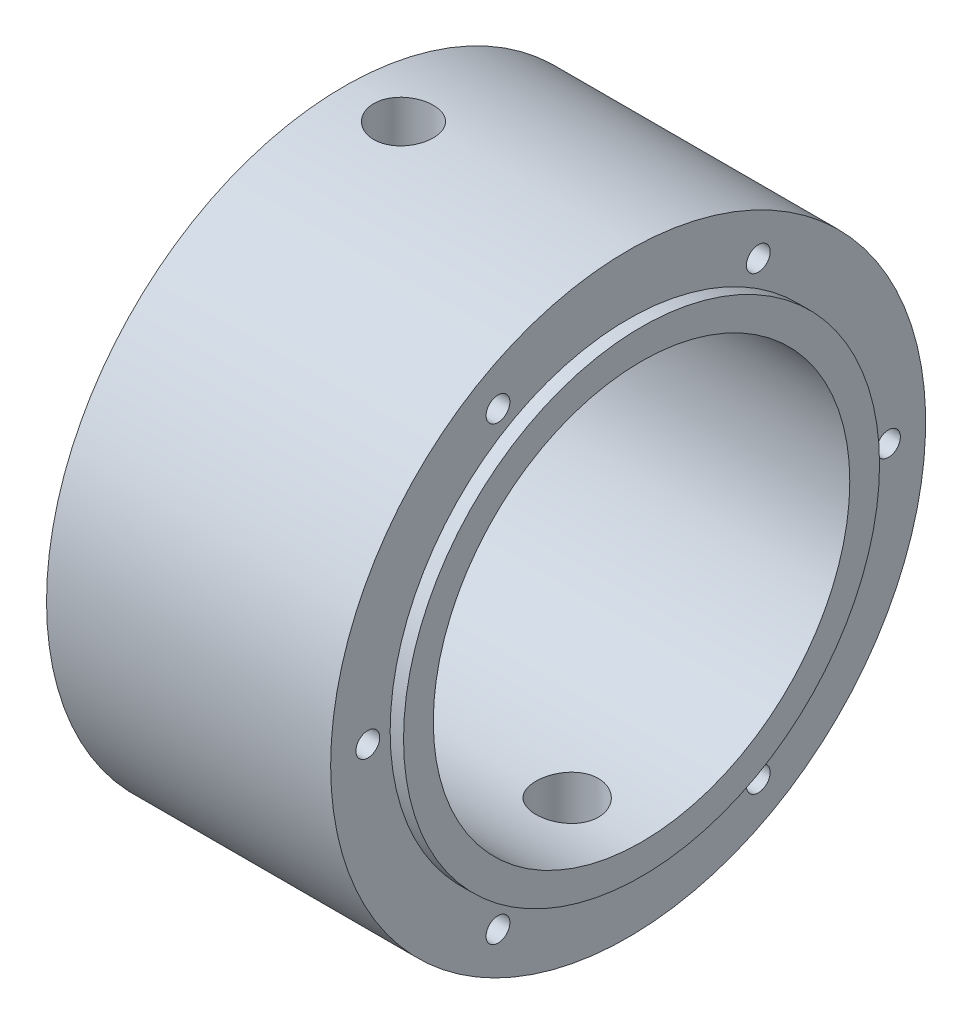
from build123d import *

# Parameters (mm, degrees)
PER_AGE1_REACH               = 49.497
PER_AGE1_BORE_R              = 2
TROU_TARAUD_M5X0_81_REACH    = 49.17
TROU_TARAUD_M5X0_81_BORE_R   = 2.1
R_P_TITION_CIRCULAIRE1_COUNT = 6


with BuildPart() as part:
    # Esquisse1 → Base-R_volution (revolve)
    with BuildSketch(Plane.XY, mode=Mode.PRIVATE) as base_r_volution_sk:
        Polygon((0, 14), (0, 20), (19.1, 20), (19.1, 16), (20, 16), (20, 14), align=None)
    revolve(base_r_volution_sk.sketch.rotate(Axis((0, 0, 0), (1, 0, 0)), 90), axis=Axis((0, 0, 0), (1, 0, 0)))

    # Per_age1 bore (on position points) → Per_age1 (cut, up to next)
    with BuildSketch(Plane(origin=(4, 20, 0), x_dir=(0, 0, 1), z_dir=(0, 1, 0)), mode=Mode.PRIVATE) as per_age1_sk1:
        Circle(PER_AGE1_BORE_R)
    per_age1_tool1 = extrude(per_age1_sk1.sketch, amount=-PER_AGE1_REACH, mode=Mode.PRIVATE) & part.part
    add(per_age1_tool1.solids().sort_by_distance((4, 20, 0))[0], mode=Mode.SUBTRACT)

    # Trou taraud_ M5x0.81 bore (on position points) → Trou taraud_ M5x0.81 (cut, up to next)
    with BuildSketch(Plane(origin=(15, -20, 0), x_dir=(0, 0, -1), z_dir=(0, -1, 0)), mode=Mode.PRIVATE) as trou_taraud_m5x0_81_sk1:
        Circle(TROU_TARAUD_M5X0_81_BORE_R)
    trou_taraud_m5x0_81_tool1 = extrude(trou_taraud_m5x0_81_sk1.sketch, amount=-TROU_TARAUD_M5X0_81_REACH, mode=Mode.PRIVATE) & part.part
    add(trou_taraud_m5x0_81_tool1.solids().sort_by_distance((15, -20, 0))[0], mode=Mode.SUBTRACT)

    # Esquisse4 → Trou taraud_ M2x0.41 (revolve, cut)
    with BuildSketch(Plane(origin=(19.1, 0, 17.5), x_dir=(0, 0, -1), z_dir=(0, 1, 0))):
        Polygon((0, 0), (0, 8.480688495), (0.8, 8), (0.8, 0), align=None)
    trou_taraud_m2x0_41 = revolve(axis=Axis((25.45, 0, 17.5), (-1, 0, 0)), mode=Mode.SUBTRACT)

    # R_p_tition circulaire1: Trou taraud_ M2x0.41 ×6 about axis
    r_p_tition_circulaire1_axis = Axis((19.1, 0, 0), (1, 0, 0))
    for i in range(1, R_P_TITION_CIRCULAIRE1_COUNT):
        add(trou_taraud_m2x0_41.rotate(r_p_tition_circulaire1_axis, i * 360 / R_P_TITION_CIRCULAIRE1_COUNT), mode=Mode.SUBTRACT)


solid = part.part
